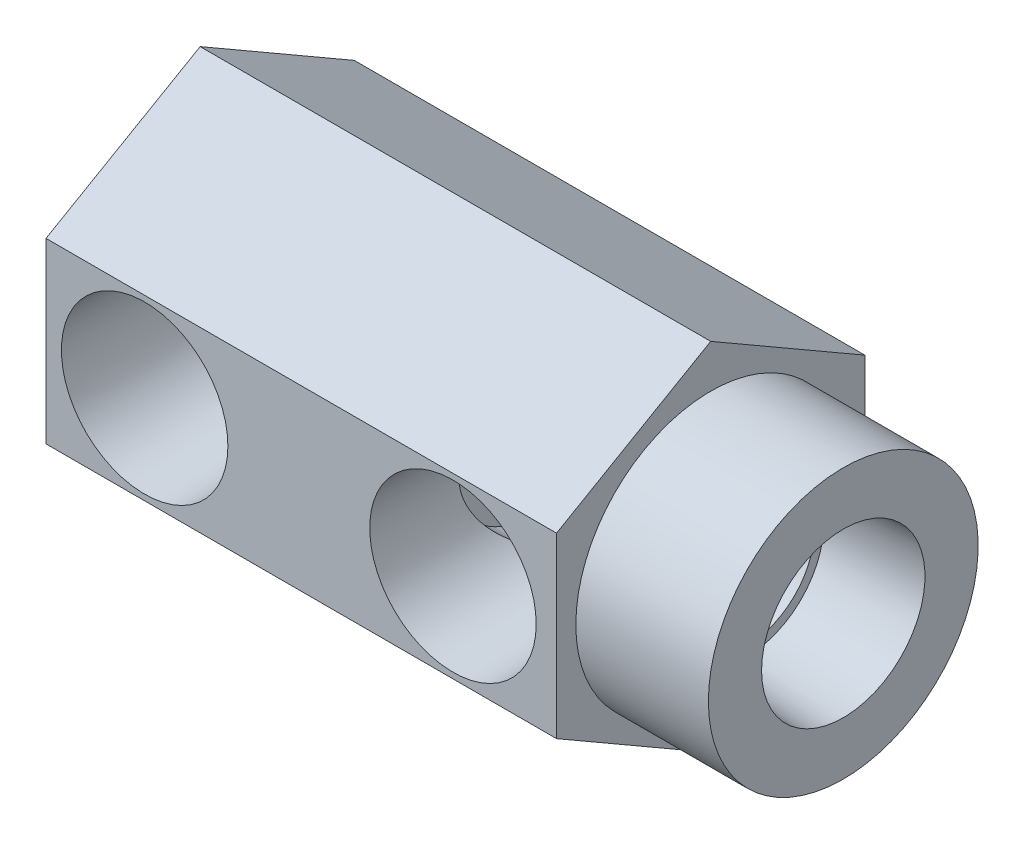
from build123d import *

# Parameters (mm, degrees)
BOSS_EXTRUDE1_DEPTH                 = 42.0624
SKETCH2_R                           = 11.1125
BOSS_EXTRUDE2_DEPTH                 = 52.9844
F_5_16_24_TAPPED_HOLE1_D            = 6.9088
F_5_16_24_TAPPED_HOLE1_DEPTH        = 41.27754
F_5_16_24_TAPPED_HOLE1_CBORE_D      = 7.9375
F_5_16_24_TAPPED_HOLE1_CBORE_DEPTH  = 36.576
F_5_16_24_TAPPED_HOLE1_TIP          = 2.075612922
F_7_32_0_21875_DIAMETER_HOLE1_D     = 5.55625
F_7_32_0_21875_DIAMETER_HOLE1_DEPTH = 44.45
F_7_32_0_21875_DIAMETER_HOLE1_TIP   = 1.669265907
F_1_4_NPT_TAPPED_HOLE1_AT_2_COUNT   = 2
F_1_4_NPT_TAPPED_HOLE1_AT_2_PITCH   = 25.4


with BuildPart() as part:
    # Sketch1 → Boss-Extrude1 (new body)
    with BuildSketch(Plane(origin=(0, 0, 0), x_dir=(0, 0, -1), z_dir=(1, 0, 0))):
        Polygon((-12.7, -7.332348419), (0, -14.664696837), (12.7, -7.332348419), (12.7, 7.332348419), (0, 14.664696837), (-12.7, 7.332348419), align=None)
    extrude(amount=BOSS_EXTRUDE1_DEPTH)

    # Sketch2 → Boss-Extrude2 (add)
    with BuildSketch(Plane(origin=(0, 0, 0), x_dir=(0, 0, -1), z_dir=(1, 0, 0))):
        with Locations(Location((0, 0, 0), (0, 0, 180))):
            Circle(SKETCH2_R)
    extrude(amount=BOSS_EXTRUDE2_DEPTH)

    # 5_16-24 Tapped Hole1
    with Locations(Plane(origin=(52.9844, 0, 0), x_dir=(0, 0, -1), z_dir=(1, 0, 0))):
        with Locations((0, 0)):
            CounterBoreHole(F_5_16_24_TAPPED_HOLE1_D / 2, F_5_16_24_TAPPED_HOLE1_CBORE_D / 2, F_5_16_24_TAPPED_HOLE1_CBORE_DEPTH, depth=F_5_16_24_TAPPED_HOLE1_DEPTH)
            with Locations((0, 0, -(F_5_16_24_TAPPED_HOLE1_DEPTH + F_5_16_24_TAPPED_HOLE1_TIP / 2))):  # 118° drill point
                Cone(0, F_5_16_24_TAPPED_HOLE1_D / 2, F_5_16_24_TAPPED_HOLE1_TIP, mode=Mode.SUBTRACT)

    # 7_32 _0.21875_ Diameter Hole1
    with Locations(Plane(origin=(52.9844, 0, 0), x_dir=(0, 0, -1), z_dir=(1, 0, 0))):
        with Locations((0, 0)):
            Hole(F_7_32_0_21875_DIAMETER_HOLE1_D / 2, depth=F_7_32_0_21875_DIAMETER_HOLE1_DEPTH)
            with Locations((0, 0, -(F_7_32_0_21875_DIAMETER_HOLE1_DEPTH + F_7_32_0_21875_DIAMETER_HOLE1_TIP / 2))):  # 118° drill point
                Cone(0, F_7_32_0_21875_DIAMETER_HOLE1_D / 2, F_7_32_0_21875_DIAMETER_HOLE1_TIP, mode=Mode.SUBTRACT)

    # Sketch7 → 1_4 NPT Tapped Hole1 (revolve, cut)
    with BuildSketch(Plane(origin=(8.128, 0, 12.7), x_dir=(0, -1, 0), z_dir=(1, 0, 0))):
        Polygon((0, 0), (0, 20.411147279), (5.5626, 17.0688), (5.5626, 10.0203), (6.557978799, 10.0203), (6.858, 0), align=None)
    f_1_4_npt_tapped_hole1 = revolve(axis=Axis((8.128, 0, 19.05), (0, 0, -1)), mode=Mode.SUBTRACT)

    # 1_4 NPT Tapped Hole1 at 2: 1_4 NPT Tapped Hole1 ×2
    with Locations(*[(i * F_1_4_NPT_TAPPED_HOLE1_AT_2_PITCH, 0, 0) for i in range(1, F_1_4_NPT_TAPPED_HOLE1_AT_2_COUNT)]):
        add(f_1_4_npt_tapped_hole1, mode=Mode.SUBTRACT)

    # Sketch9 → 1_4 NPT Tapped Hole2 (revolve, cut)
    with BuildSketch(Plane(origin=(8.128, 0, -12.7), x_dir=(0, 1, 0), z_dir=(1, 0, 0))):
        Polygon((0, 0), (0, 20.411147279), (5.5626, 17.0688), (5.5626, 10.0203), (6.557978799, 10.0203), (6.858, 0), align=None)
    revolve(axis=Axis((8.128, 0, -19.05), (0, 0, 1)), mode=Mode.SUBTRACT)

    # Sketch11 → Cut-Revolve1 (revolve, cut)
    with BuildSketch(Plane.XY, mode=Mode.PRIVATE) as cut_revolve1_sk:
        Polygon((52.9844, 6.731), (45.0596, 6.315678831), (45.0596, 5.5499), (26.79065, 5.5499), (26.79065, 0), (52.9844, 0), align=None)
    revolve(cut_revolve1_sk.sketch.rotate(Axis((0, 0, 0), (1, 0, 0)), 90), axis=Axis((0, 0, 0), (1, 0, 0)), mode=Mode.SUBTRACT)


solid = part.part
